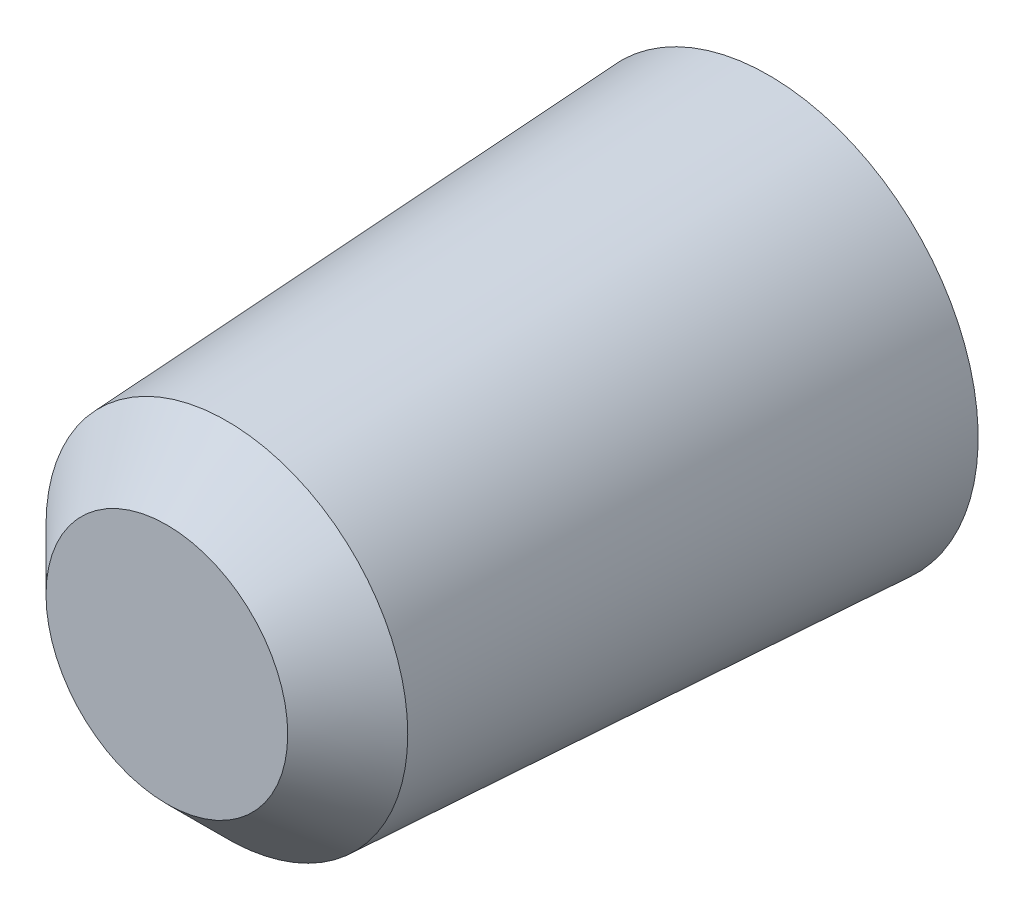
ISO-10303-21;
HEADER;
FILE_DESCRIPTION(('STEP AP214'),'2;1');
FILE_NAME('part.step','',(''),(''),'','','');
FILE_SCHEMA(('AUTOMOTIVE_DESIGN { 1 0 10303 214 1 1 1 1 }'));
ENDSEC;
DATA;
#1=APPLICATION_CONTEXT('core data for automotive mechanical design processes');
#2=APPLICATION_PROTOCOL_DEFINITION('international standard','automotive_design',2000,#1);
#3=PRODUCT_CONTEXT('',#1,'mechanical');
#4=PRODUCT('Part','Part','',(#3));
#5=PRODUCT_RELATED_PRODUCT_CATEGORY('part','',(#4));
#6=PRODUCT_DEFINITION_FORMATION('','',#4);
#7=PRODUCT_DEFINITION_CONTEXT('part definition',#1,'design');
#8=PRODUCT_DEFINITION('design','',#6,#7);
#9=PRODUCT_DEFINITION_SHAPE('','',#8);
#10=(LENGTH_UNIT() NAMED_UNIT(*) SI_UNIT(.MILLI.,.METRE.));
#11=(NAMED_UNIT(*) PLANE_ANGLE_UNIT() SI_UNIT($,.RADIAN.));
#12=(NAMED_UNIT(*) SI_UNIT($,.STERADIAN.) SOLID_ANGLE_UNIT());
#13=UNCERTAINTY_MEASURE_WITH_UNIT(LENGTH_MEASURE(1.E-05),#10,'distance_accuracy_value','');
#14=(GEOMETRIC_REPRESENTATION_CONTEXT(3) GLOBAL_UNCERTAINTY_ASSIGNED_CONTEXT((#13)) GLOBAL_UNIT_ASSIGNED_CONTEXT((#10,
#11,#12)) REPRESENTATION_CONTEXT('',''));
#15=CARTESIAN_POINT('',(0.,0.,0.));
#16=DIRECTION('',(0.,0.,1.));
#17=DIRECTION('',(1.,0.,0.));
#18=AXIS2_PLACEMENT_3D('',#15,#16,#17);
#19=CARTESIAN_POINT('',(20.6363008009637,75.3927738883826,0.));
#20=DIRECTION('',(0.,0.,-1.));
#21=DIRECTION('',(1.,0.,0.));
#22=AXIS2_PLACEMENT_3D('',#19,#20,#21);
#23=PLANE('',#22);
#24=CARTESIAN_POINT('',(20.6363008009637,75.3927738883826,0.));
#25=DIRECTION('',(0.,0.,1.));
#26=DIRECTION('',(1.,0.,0.));
#27=AXIS2_PLACEMENT_3D('',#24,#25,#26);
#28=CIRCLE('',#27,17.);
#29=CARTESIAN_POINT('',(37.6363008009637,75.3927738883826,0.));
#30=VERTEX_POINT('',#29);
#31=EDGE_CURVE('E10',#30,#30,#28,.F.);
#32=ORIENTED_EDGE('',*,*,#31,.F.);
#33=EDGE_LOOP('',(#32));
#34=FACE_BOUND('',#33,.T.);
#35=ADVANCED_FACE('F35',(#34),#23,.F.);
#36=CARTESIAN_POINT('',(20.6363008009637,75.3927738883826,0.));
#37=DIRECTION('',(0.,0.,-1.));
#38=DIRECTION('',(1.,0.,0.));
#39=AXIS2_PLACEMENT_3D('',#36,#37,#38);
#40=CONICAL_SURFACE('',#39,25.,0.0523598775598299);
#41=CARTESIAN_POINT('',(20.6363008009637,75.3927738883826,-8.44245005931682));
#42=DIRECTION('',(0.,0.,-1.));
#43=DIRECTION('',(-1.,0.,0.));
#44=AXIS2_PLACEMENT_3D('',#41,#42,#43);
#45=CIRCLE('',#44,25.4424500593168);
#46=CARTESIAN_POINT('',(-4.80614925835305,75.3927738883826,-8.44245005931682));
#47=VERTEX_POINT('',#46);
#48=EDGE_CURVE('E42',#47,#47,#45,.F.);
#49=ORIENTED_EDGE('',*,*,#48,.F.);
#50=EDGE_LOOP('',(#49));
#51=FACE_BOUND('',#50,.T.);
#52=CARTESIAN_POINT('',(20.6363008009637,75.3927738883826,-84.6813627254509));
#53=DIRECTION('',(0.,0.,-1.));
#54=DIRECTION('',(-1.,0.,0.));
#55=AXIS2_PLACEMENT_3D('',#52,#53,#54);
#56=CIRCLE('',#55,29.4379621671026);
#57=CARTESIAN_POINT('',(-8.80166136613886,75.3927738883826,-84.6813627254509));
#58=VERTEX_POINT('',#57);
#59=EDGE_CURVE('E46',#58,#58,#56,.T.);
#60=ORIENTED_EDGE('',*,*,#59,.F.);
#61=EDGE_LOOP('',(#60));
#62=FACE_BOUND('',#61,.T.);
#63=ADVANCED_FACE('F55',(#51,#62),#40,.T.);
#64=CARTESIAN_POINT('',(0.,0.,-84.6813627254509));
#65=DIRECTION('',(0.,0.,1.));
#66=DIRECTION('',(-1.,0.,0.));
#67=AXIS2_PLACEMENT_3D('',#64,#65,#66);
#68=PLANE('',#67);
#69=ORIENTED_EDGE('',*,*,#59,.T.);
#70=EDGE_LOOP('',(#69));
#71=FACE_BOUND('',#70,.T.);
#72=ADVANCED_FACE('F53',(#71),#68,.F.);
#73=CARTESIAN_POINT('',(20.6363008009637,75.3927738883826,-8.44245005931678));
#74=DIRECTION('',(0.,0.,-1.));
#75=DIRECTION('',(1.,0.,0.));
#76=AXIS2_PLACEMENT_3D('',#73,#74,#75);
#77=CONICAL_SURFACE('',#76,25.4424500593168,0.78539816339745);
#78=ORIENTED_EDGE('',*,*,#31,.T.);
#79=EDGE_LOOP('',(#78));
#80=FACE_BOUND('',#79,.T.);
#81=ORIENTED_EDGE('',*,*,#48,.T.);
#82=EDGE_LOOP('',(#81));
#83=FACE_BOUND('',#82,.T.);
#84=ADVANCED_FACE('F37',(#80,#83),#77,.T.);
#85=CLOSED_SHELL('',(#35,#63,#72,#84));
#86=MANIFOLD_SOLID_BREP('B2',#85);
#87=ADVANCED_BREP_SHAPE_REPRESENTATION('',(#18,#86),#14);
#88=SHAPE_DEFINITION_REPRESENTATION(#9,#87);
ENDSEC;
END-ISO-10303-21;
